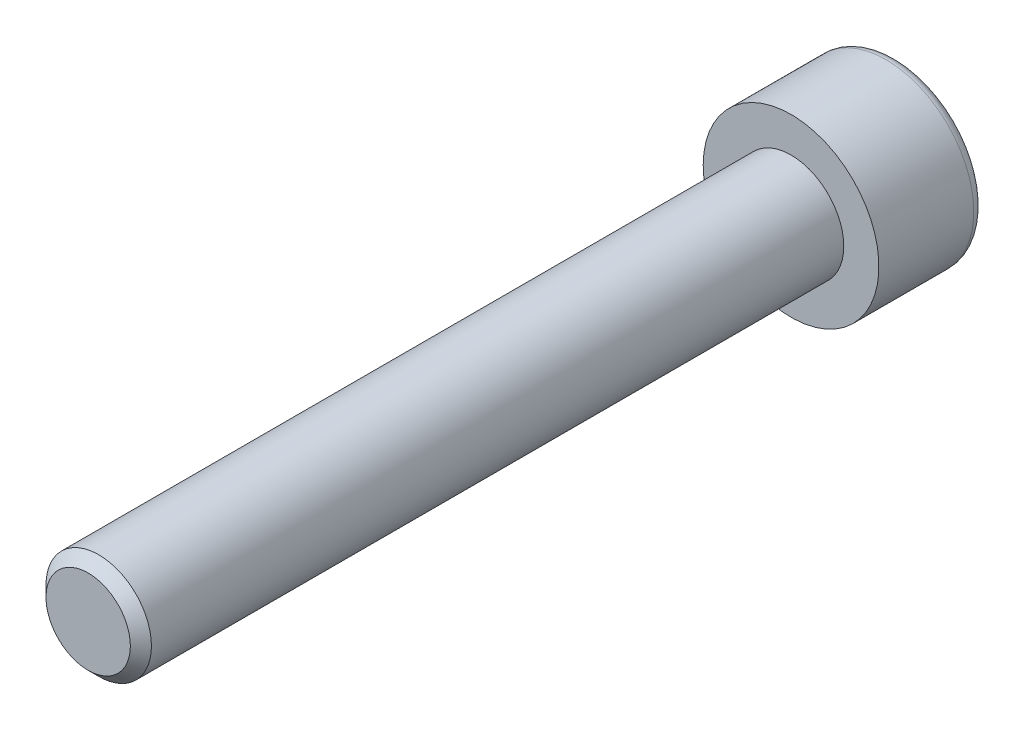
from build123d import *

# Parameters (mm, degrees)
ENLEV_MAT_EXTRU1_DEPTH = 3
ESQUISSE3_W            = 3
ESQUISSE3_H            = 40
CHANFREIN1_SIZE        = 0.6


with BuildPart() as part:
    # Esquisse1 → Base-R_volution (revolve)
    with BuildSketch(Plane(origin=(0, 0, 0), x_dir=(1, 0, 0), z_dir=(0, 1, 0)), mode=Mode.PRIVATE) as base_r_volution_sk:
        with BuildLine():
            Line((0, 0), (5, 0))
            Line((5, 0), (5, 5.4))
            ThreePointArc((5, 5.4), (4.824264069, 5.824264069), (4.4, 6))
            Line((4.4, 6), (0, 6))
            Line((0, 6), (0, 0))
        make_face()
    revolve(base_r_volution_sk.sketch.rotate(Axis((0, 0, 0), (0, 0, -1)), 180), axis=Axis((0, 0, 0), (0, 0, -1)))

    # Esquisse2 → enlev-mat-Extru1 (cut)
    with BuildSketch(Plane.XY.offset(-6)):
        Polygon((2.5, -1.443375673), (2.5, 1.443375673), (0, 2.886751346), (-2.5, 1.443375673), (-2.5, -1.443375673), (0, -2.886751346), align=None)
    extrude(amount=ENLEV_MAT_EXTRU1_DEPTH, mode=Mode.SUBTRACT)

    # Esquisse3 → Boss.-R_vol.1 (revolve)
    with BuildSketch(Plane(origin=(0, 0, 0), x_dir=(1, 0, 0), z_dir=(0, 1, 0))):
        with Locations((1.5, -20)):
            Rectangle(ESQUISSE3_W, ESQUISSE3_H)
    revolve(axis=Axis((0, 0, 0), (0, 0, 1)))

    # Chanfrein1
    chanfrein1_edges = [part.edges().sort_by_distance(p)[0] for p in [
        (-3, 0, 40),
    ]]
    chamfer(chanfrein1_edges, length=CHANFREIN1_SIZE)


solid = part.part
